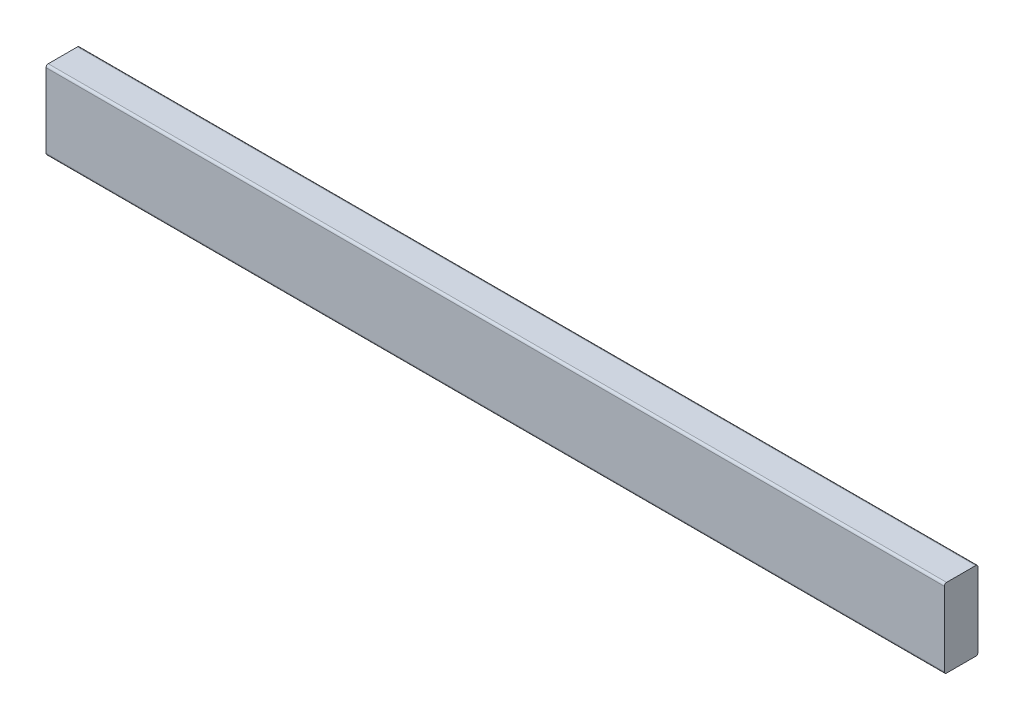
from build123d import *

# Parameters (mm, degrees)
SKETCH1_W      = 38.1
SKETCH1_H      = 88.9
EXTRUDE1_DEPTH = 508
FILLET1_R      = 2.54


with BuildPart() as part:
    # Sketch1 → Extrude1 (new, symmetric)
    with BuildSketch(Plane(origin=(0, 0, 0), x_dir=(0, 0, -1), z_dir=(1, 0, 0))):
        Rectangle(SKETCH1_W, SKETCH1_H)
    extrude(amount=EXTRUDE1_DEPTH, both=True)

    # Fillet1
    fillet1_edges = [part.edges().sort_by_distance(p)[0] for p in [
        (0, -44.45, -19.05),
        (0, -44.45, 19.05),
        (0, 44.45, 19.05),
        (0, 44.45, -19.05),
    ]]
    fillet(fillet1_edges, radius=FILLET1_R)


solid = part.part
